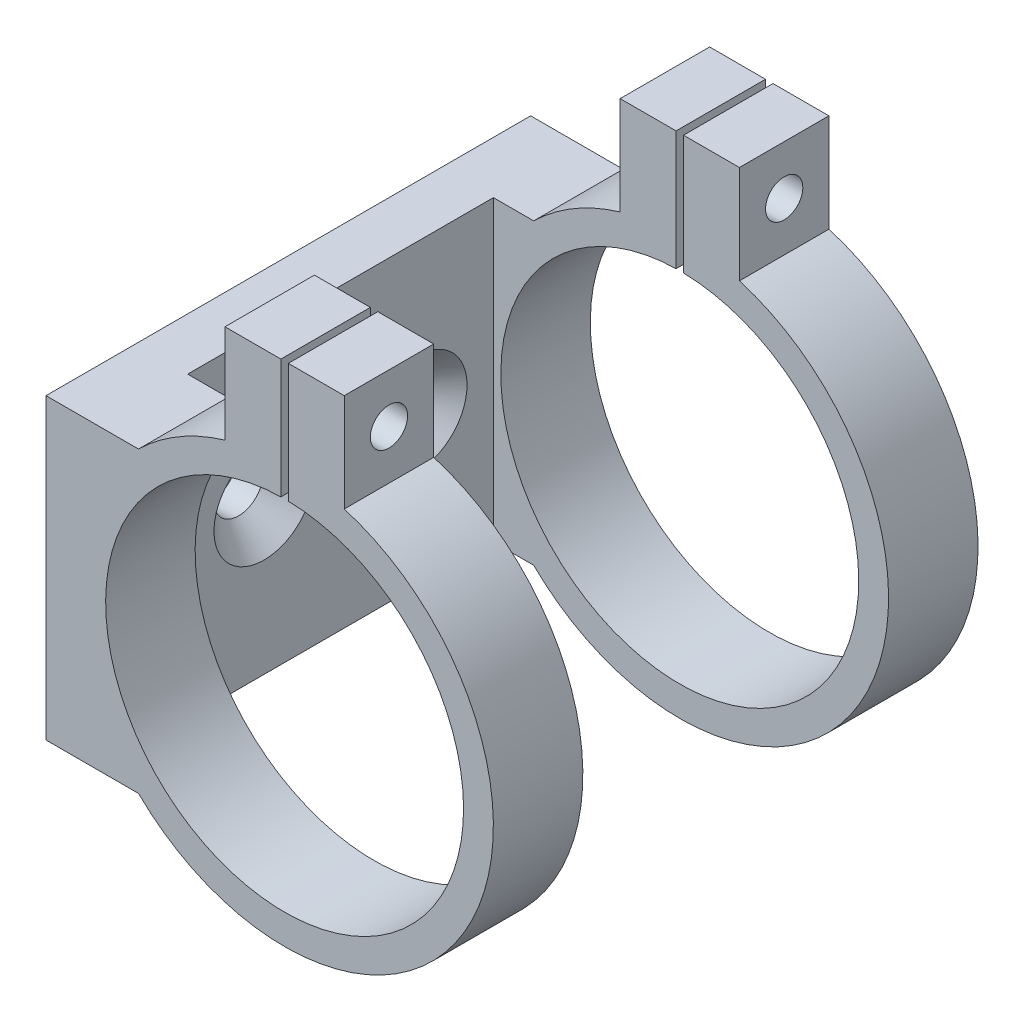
from build123d import *

# Parameters (mm, degrees)
SKETCH1_R                     = 24
BOSS_EXTRUDE1_DEPTH           = 32.5
SKETCH2_W                     = 41
SKETCH2_H                     = 68.678545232
CUT_EXTRUDE1_DEPTH            = 74.927329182
CUT_EXTRUDE2_START            = -65
SKETCH3_W                     = 1
SKETCH3_H                     = 30.46335581
CUT_EXTRUDE2_DEPTH            = 65
CUT_EXTRUDE3_REACH            = 67.24
SKETCH4_R                     = 2.5
CSK_FOR_M6_SFHCS1_D           = 6.6
CSK_FOR_M6_SFHCS1_CSINK_D     = 13.44
CSK_FOR_M6_SFHCS1_CSINK_ANGLE = 90


with BuildPart() as part:
    # Sketch1 → Boss-Extrude1 (new, symmetric)
    with BuildSketch(Plane.XY):
        with BuildLine():
            Line((8, 26.83281573), (8, 40))
            Line((8, 40), (-8, 40))
            Line((-8, 40), (-8, 26.83281573))
            ThreePointArc((-8, 26.83281573), (-14.214623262, 24.123525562), (-19.595917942, 20))
            Line((-19.595917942, 20), (-32, 20))
            Line((-32, 20), (-32, -20))
            Line((-32, -20), (-19.595917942, -20))
            ThreePointArc((-19.595917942, -20), (24.123525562, -14.214623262), (8, 26.83281573))
        make_face()
        Circle(SKETCH1_R, mode=Mode.SUBTRACT)
    extrude(amount=BOSS_EXTRUDE1_DEPTH, both=True)

    # Sketch2 → Cut-Extrude1 (cut, through all)
    with BuildSketch(Plane.ZY.offset(25)):
        with Locations((0, 5.660727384)):
            Rectangle(SKETCH2_W, SKETCH2_H)
    extrude(amount=-CUT_EXTRUDE1_DEPTH, mode=Mode.SUBTRACT)

    # Sketch3 → Cut-Extrude2 (cut)
    with BuildSketch(Plane.XY.offset(32.5).offset(CUT_EXTRUDE2_START)):
        with Locations((0, 32)):
            Rectangle(SKETCH3_W, SKETCH3_H)
    extrude(amount=CUT_EXTRUDE2_DEPTH, mode=Mode.SUBTRACT)

    # Cut-Extrude3: up to this face of the body (flat: up to its plane)
    cut_extrude3_end = Plane(part.part.faces().sort_by_distance((-8, 33.416407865, 26.5))[0])
    # Sketch4 → Cut-Extrude3 (cut, up to the picked face)
    with BuildSketch(Plane(origin=(8, 0, 0), x_dir=(0, 0, -1), z_dir=(1, 0, 0)), mode=Mode.PRIVATE) as cut_extrude3_sk1:
        with Locations((26.5, 33.416407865)):
            Circle(SKETCH4_R)
    cut_extrude3_tool1 = split(extrude(cut_extrude3_sk1.sketch, amount=-CUT_EXTRUDE3_REACH, mode=Mode.PRIVATE), bisect_by=cut_extrude3_end, keep=Keep.BOTH, mode=Mode.PRIVATE)
    # Sketch4 → Cut-Extrude3 (cut, up to the picked face)
    with BuildSketch(Plane(origin=(8, 0, 0), x_dir=(0, 0, -1), z_dir=(1, 0, 0)), mode=Mode.PRIVATE) as cut_extrude3_sk2:
        with Locations((-26.5, 33.416407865)):
            Circle(SKETCH4_R)
    cut_extrude3_tool2 = split(extrude(cut_extrude3_sk2.sketch, amount=-CUT_EXTRUDE3_REACH, mode=Mode.PRIVATE), bisect_by=cut_extrude3_end, keep=Keep.BOTH, mode=Mode.PRIVATE)
    add(cut_extrude3_tool1.solids().sort_by(Axis((8, 33.416408, -26.5), (-1, 0, 0)))[0], mode=Mode.SUBTRACT)
    add(cut_extrude3_tool2.solids().sort_by(Axis((8, 33.416408, 26.5), (-1, 0, 0)))[0], mode=Mode.SUBTRACT)

    # CSK for M6 SFHCS1 (through all)
    with Locations(Plane(origin=(-25, 0, 0), x_dir=(0, 0, -1), z_dir=(1, 0, 0))):
        with Locations((-10.25, 0), (10.25, 0)):
            CounterSinkHole(CSK_FOR_M6_SFHCS1_D / 2, CSK_FOR_M6_SFHCS1_CSINK_D / 2, counter_sink_angle=CSK_FOR_M6_SFHCS1_CSINK_ANGLE)


solid = part.part
